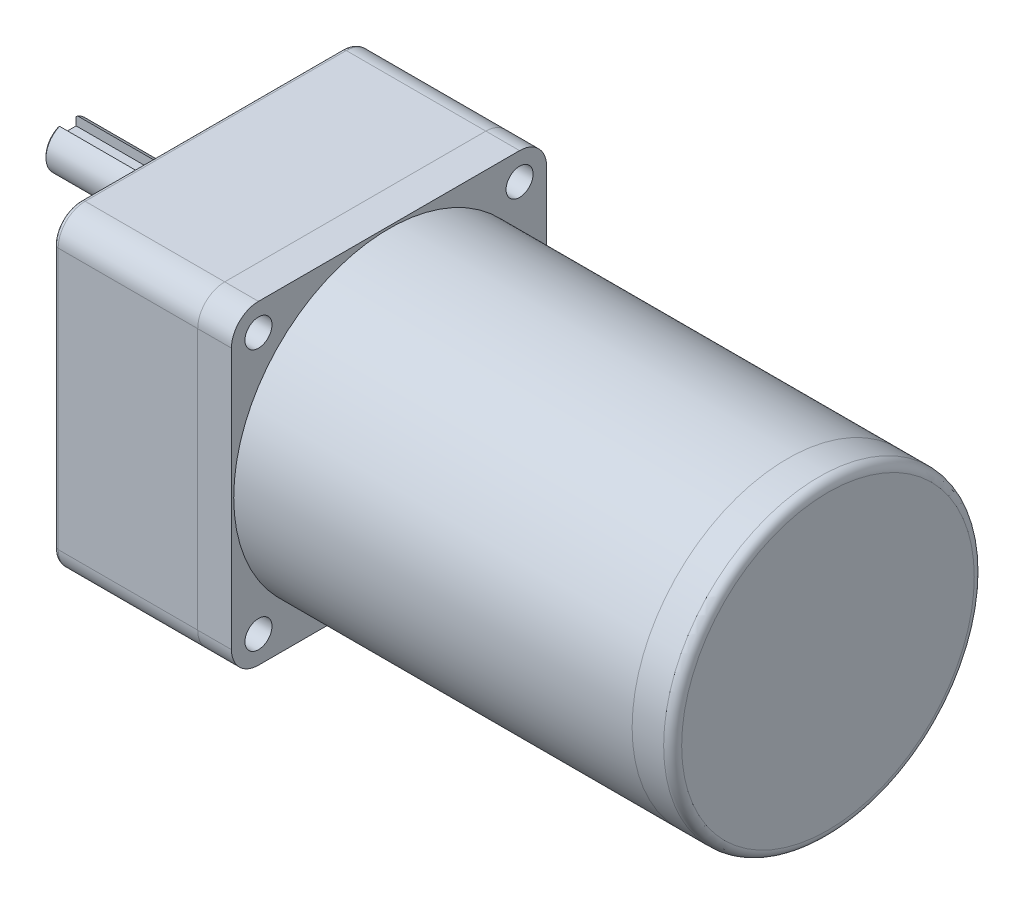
from build123d import *

# Parameters (mm, degrees)
EXTRUDE_1_DEPTH             = 32
EXTRUDE_2_DEPTH             = 7.5
FILLET_1_R                  = 1
HOLE_WIZARD_M5_1_AT_2_COUNT = 2
HOLE_WIZARD_M5_1_AT_2_PITCH = 57.982756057
HOLE_WIZARD_M5_1_AT_3_COUNT = 2
HOLE_WIZARD_M5_1_AT_3_PITCH = 82
HOLE_WIZARD_M5_1_AT_4_COUNT = 2
HOLE_WIZARD_M5_1_AT_4_PITCH = 57.982756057
SKETCH_7_R                  = 3
CUT_EXTRUDE_1_DEPTH         = 25.5
SKETCH_8_R                  = 12
EXTRUDE_5_DEPTH             = 3
SKETCH_9_R                  = 5
EXTRUDE_6_DEPTH             = 29
FILLET_3_R                  = 0.5
SKETCH_10_R                 = 30
CUT_EXTRUDE_2_DEPTH         = 0.5
CUT_EXTRUDE_3_DEPTH         = 2.5
CHAMFER_1_SIZE              = 0.3
SKETCH_12_R                 = 34.5
EXTRUDE_7_DEPTH             = 88.5
SKETCH_13_R                 = 34.5
EXTRUDE_8_DEPTH             = 9
FILLET_4_R                  = 2


with BuildPart() as part:
    # Sketch 1 → Extrude 1 (new body)
    with BuildSketch(Plane(origin=(0, 0, 0), x_dir=(0, 0, -1), z_dir=(1, 0, 0))):
        with BuildLine():
            Line((29, -35), (-29, -35))
            ThreePointArc((-29, -35), (-33.242640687, -33.242640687), (-35, -29))
            Line((-35, -29), (-35, 29))
            ThreePointArc((-35, 29), (-33.242640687, 33.242640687), (-29, 35))
            Line((-29, 35), (29, 35))
            ThreePointArc((29, 35), (33.242640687, 33.242640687), (35, 29))
            Line((35, 29), (35, -29))
            ThreePointArc((35, -29), (33.242640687, -33.242640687), (29, -35))
        make_face()
    extrude(amount=EXTRUDE_1_DEPTH)

    # Fillet 1
    fillet_1_edges = [part.edges().sort_by_distance(p)[0] for p in [
        (0, -35, 0),
        (0, -33.242640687, 33.242640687),
        (0, 0, 35),
        (0, 33.242640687, 33.242640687),
        (0, 35, 0),
        (0, 33.242640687, -33.242640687),
        (0, 0, -35),
        (0, -33.242640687, -33.242640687),
    ]]
    fillet(fillet_1_edges, radius=FILLET_1_R)

    # Sketch 6 → Hole Wizard M5 _1 (revolve, cut)
    with BuildSketch(Plane(origin=(0, 28.991378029, -28.991378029), x_dir=(0, 0, 1), z_dir=(0, 1, 0))):
        Polygon((0, 0), (0, 15.2618073), (2.1, 14), (2.1, 0), align=None)
    hole_wizard_m5_1 = revolve(axis=Axis((-6.35, 28.991378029, -28.991378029), (1, 0, 0)), mode=Mode.SUBTRACT)

    # Hole Wizard M5 _1 at 2: Hole Wizard M5 _1 ×2
    with Locations(*[(0, -i * HOLE_WIZARD_M5_1_AT_2_PITCH, 0) for i in range(1, HOLE_WIZARD_M5_1_AT_2_COUNT)]):
        add(hole_wizard_m5_1, mode=Mode.SUBTRACT)

    # Hole Wizard M5 _1 at 3: Hole Wizard M5 _1 ×2
    with Locations(*[Vector(0, -0.7071067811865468, 0.7071067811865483) * (i * HOLE_WIZARD_M5_1_AT_3_PITCH) for i in range(1, HOLE_WIZARD_M5_1_AT_3_COUNT)]):
        add(hole_wizard_m5_1, mode=Mode.SUBTRACT)

    # Hole Wizard M5 _1 at 4: Hole Wizard M5 _1 ×2
    with Locations(*[(0, 0, i * HOLE_WIZARD_M5_1_AT_4_PITCH) for i in range(1, HOLE_WIZARD_M5_1_AT_4_COUNT)]):
        add(hole_wizard_m5_1, mode=Mode.SUBTRACT)


with BuildPart() as body_2:
    # Sketch 2 → Extrude 2 (new body)
    with BuildSketch(Plane(origin=(32, 0, 0), x_dir=(0, 0, -1), z_dir=(1, 0, 0))):
        with BuildLine():
            Line((-29, -35), (29, -35))
            ThreePointArc((29, -35), (33.242640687, -33.242640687), (35, -29))
            Line((35, -29), (35, 29))
            ThreePointArc((35, 29), (33.242640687, 33.242640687), (29, 35))
            Line((29, 35), (-29, 35))
            ThreePointArc((-29, 35), (-33.242640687, 33.242640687), (-35, 29))
            Line((-35, 29), (-35, -29))
            ThreePointArc((-35, -29), (-33.242640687, -33.242640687), (-29, -35))
        make_face()
    extrude(amount=EXTRUDE_2_DEPTH)


with BuildPart() as cut_extrude_1_tool:
    # Sketch 7 → Cut-Extrude 1 (new body)
    with BuildSketch(Plane(origin=(39.5, 0, 0), x_dir=(0, 0, -1), z_dir=(1, 0, 0))):
        with Locations((-29, 29)):
            Circle(SKETCH_7_R)
        with Locations((29, 29)):
            Circle(SKETCH_7_R)
        with Locations((29, -29)):
            Circle(SKETCH_7_R)
        with Locations((-29, -29)):
            Circle(SKETCH_7_R)
    extrude(amount=-CUT_EXTRUDE_1_DEPTH)


with BuildPart() as part_1:
    add(part.part)

    # Cut-Extrude 1: cut by cut_extrude_1_tool
    add(cut_extrude_1_tool.part, mode=Mode.SUBTRACT)

    # Sketch 10 → Cut-Extrude 2 (cut)
    with BuildSketch(Plane.ZY):
        Circle(SKETCH_10_R)
    extrude(amount=-CUT_EXTRUDE_2_DEPTH, mode=Mode.SUBTRACT)


with BuildPart() as body_2_1:
    add(body_2.part)

    # Cut-Extrude 1: cut by cut_extrude_1_tool
    add(cut_extrude_1_tool.part, mode=Mode.SUBTRACT)


with BuildPart() as body_3:
    # Sketch 8 → Extrude 5 (new body)
    with BuildSketch(Plane.ZY):
        with Locations((0, 15)):
            Circle(SKETCH_8_R)
    extrude(amount=EXTRUDE_5_DEPTH)

    # Fillet 3
    fillet_3_edges = [body_3.edges().sort_by_distance(p)[0] for p in [
        (-3, 15, -12),
    ]]
    fillet(fillet_3_edges, radius=FILLET_3_R)


with BuildPart() as body_4:
    # Sketch 9 → Extrude 6 (new body)
    with BuildSketch(Plane.ZY.offset(3)):
        with Locations(Location((0, 15, 0), (0, 0, 180))):
            Circle(SKETCH_9_R)
    extrude(amount=EXTRUDE_6_DEPTH)

    # Sketch 11 → Cut-Extrude 3 (cut)
    with BuildSketch(Plane(origin=(0, 20, 0), x_dir=(1, 0, 0), z_dir=(0, 1, 0))):
        with BuildLine():
            Line((-9, 2), (-32, 2))
            Line((-32, 2), (-32, -2))
            Line((-32, -2), (-9, -2))
            ThreePointArc((-9, -2), (-7, 0), (-9, 2))
        make_face()
    extrude(amount=-CUT_EXTRUDE_3_DEPTH, mode=Mode.SUBTRACT)

    # Chamfer 1
    chamfer_1_edges = [body_4.edges().sort_by_distance(p)[0] for p in [
        (-32, 10.816699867, 2.738612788),
    ]]
    chamfer(chamfer_1_edges, length=CHAMFER_1_SIZE)


with BuildPart() as body_5:
    # Sketch 12 → Extrude 7 (new body)
    with BuildSketch(Plane(origin=(39.5, 0, 0), x_dir=(0, 0, -1), z_dir=(1, 0, 0))):
        Circle(SKETCH_12_R)
    extrude(amount=EXTRUDE_7_DEPTH)


with BuildPart() as body_6:
    # Sketch 13 → Extrude 8 (new body)
    with BuildSketch(Plane(origin=(128, 0, 0), x_dir=(0, 0, -1), z_dir=(1, 0, 0))):
        Circle(SKETCH_13_R)
    extrude(amount=EXTRUDE_8_DEPTH)

    # Fillet 4
    fillet_4_edges = [body_6.edges().sort_by_distance(p)[0] for p in [
        (137, 0, 34.5),
    ]]
    fillet(fillet_4_edges, radius=FILLET_4_R)


solid = Compound([part_1.part, body_2_1.part, body_3.part, body_4.part, body_5.part, body_6.part])
